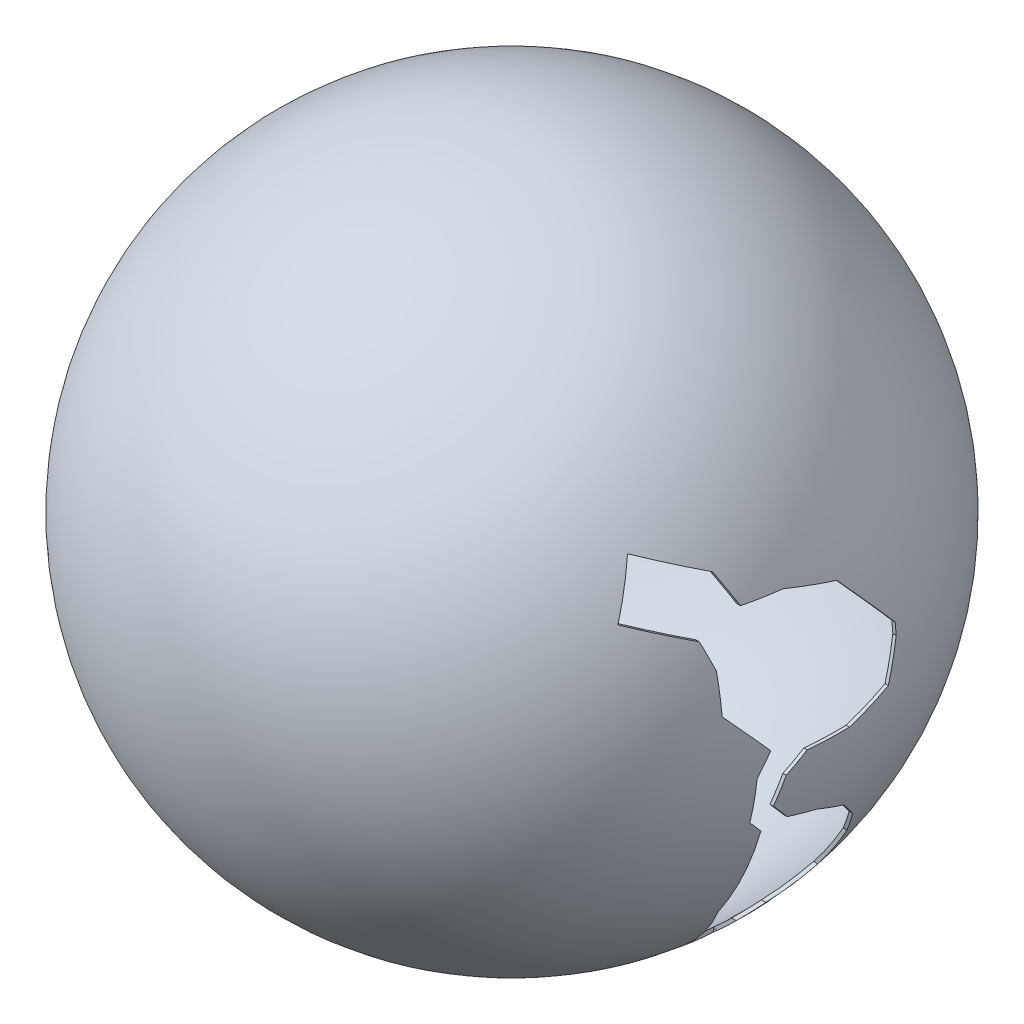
from build123d import *

# Parameters (mm, degrees)
EXTRUDE4_DEPTH = 75.2


with BuildPart() as part:
    # Sketch1 → Revolve1 (revolve)
    with BuildSketch(Plane.XY):
        with BuildLine():
            Line((0, 100), (0, 99))
            ThreePointArc((0, 99), (99, 0), (0, -99))
            Line((0, -99), (0, -100))
            ThreePointArc((0, -100), (100, 0), (0, 100))
        make_face()
    revolve(axis=Axis((0, 47.22392746, 0), (0, -1, 0)))


with BuildPart() as body_2:
    # Sketch2 → Extrude4 (new body)
    with BuildSketch(Plane(origin=(139.987557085, 0, 0), x_dir=(0, 0, -1), z_dir=(1, 0, 0))):
        Polygon((-41.833344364, 48.399761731), (-33.417168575, 44.439208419), (-26.431504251, 41.151836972), (-22.525646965, 32.557548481), (-11.634125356, 32.557548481), (2.722880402, 28.596995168), (10.148917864, 20.180819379), (18.528493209, 10.683967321), (18.528493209, 7.309021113), (15.423907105, -3.945103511), (2.722880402, -8.038122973), (-9.653848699, -8.038122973), (-14.893491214, -12.661336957), (-17.079886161, -20.587018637), (-12.330110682, -25.970097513), (-3.465484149, -28.415511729), (6.435899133, -33.074986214), (12.556525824, -40.011696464), (15.064322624, -47.793627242), (15.064322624, -61.126402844), (9.073393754, -63.05703326), (1.485207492, -65.502394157), (-3.465484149, -69.870651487), (-3.465484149, -75.367529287), (-6.808954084, -82.4724029), (-12.330110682, -82.4724029), (-12.330110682, -75.367529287), (-14.704998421, -67.998027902), (-18.871269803, -55.06969356), (-18.871269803, -47.450610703), (-18.871269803, -35.266926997), (-18.871269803, -27.192804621), (-22.525646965, -23.05117717), (-22.525646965, -16.624177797), (-22.525646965, -10.349729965), (-19.511705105, -3.945103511), (-25.92309309, 3.321136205), (-30.930761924, 8.996494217), (-30.930761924, 20.180819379), (-33.336014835, 27.644546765), (-39.872919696, 30.720737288), (-48.289095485, 34.6812906), (-45.591943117, 40.412739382), align=None)
    extrude(amount=-EXTRUDE4_DEPTH)


with BuildPart() as part_1:
    add(part.part)

    # Combine1: cut body 2
    add(body_2.part, mode=Mode.SUBTRACT)


solid = part_1.part
